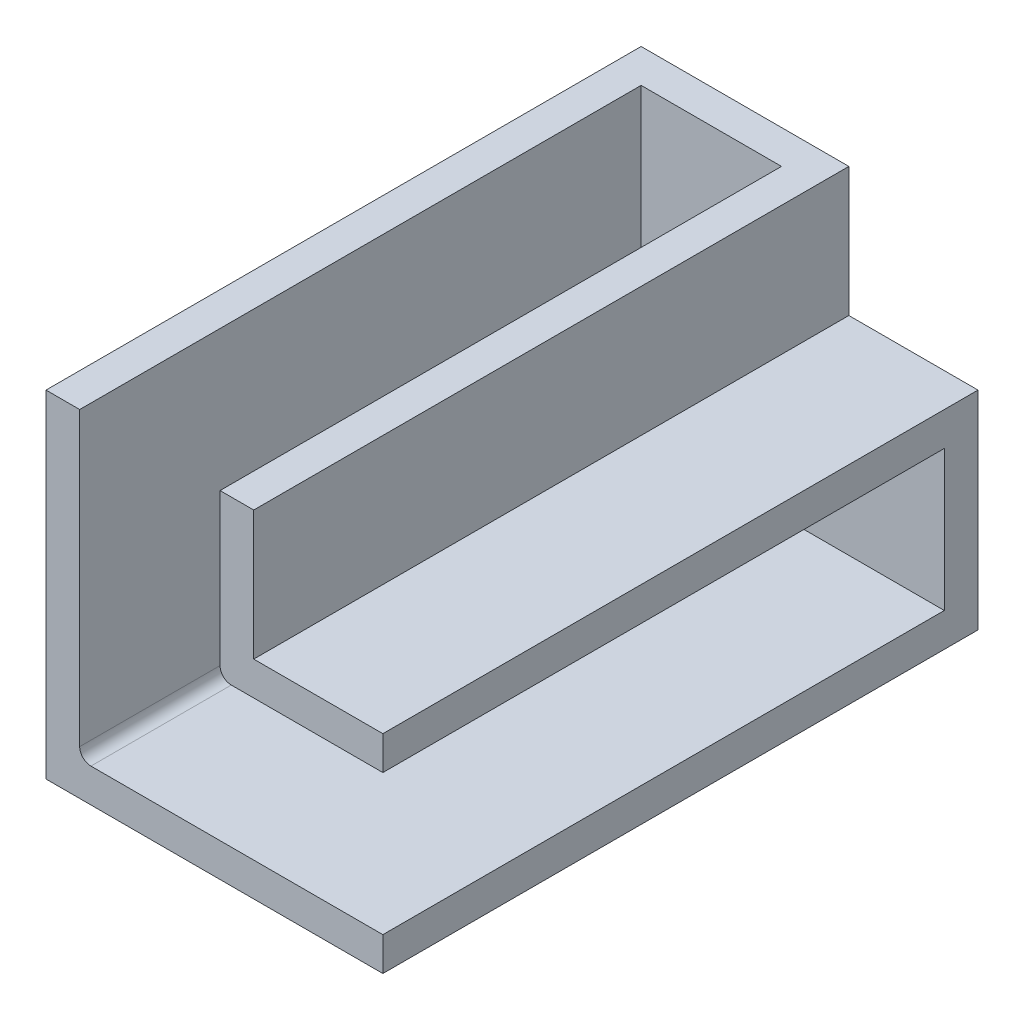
from build123d import *

# Parameters (mm, degrees)
BOSS_EXTRUDE1_DEPTH = 53
SHELL3_T            = -3
FILLET1_R           = 1


with BuildPart() as part:
    # Sketch1 → Boss-Extrude1 (new body)
    with BuildSketch(Plane.XY):
        Polygon((-50.571428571, -7.357142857), (-32.071428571, -7.357142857), (-32.071428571, -18.857142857), (-20.571428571, -18.857142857), (-20.571428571, -37.357142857), (-50.571428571, -37.357142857), align=None)
    extrude(amount=BOSS_EXTRUDE1_DEPTH)

    # Shell3
    shell3_openings = [part.faces().sort_by_distance(p)[0] for p in [
        (-37.164802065, -23.950516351, 53),
        (-41.321428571, -7.357142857, 26.5),
        (-20.571428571, -28.107142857, 26.5),
    ]]
    offset(amount=SHELL3_T, openings=shell3_openings, kind=Kind.INTERSECTION)

    # Fillet1
    fillet1_edges = [part.edges().sort_by_distance(p)[0] for p in [
        (-47.571428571, -34.357142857, 28),
        (-35.071428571, -21.857142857, 28),
    ]]
    fillet(fillet1_edges, radius=FILLET1_R)


solid = part.part
